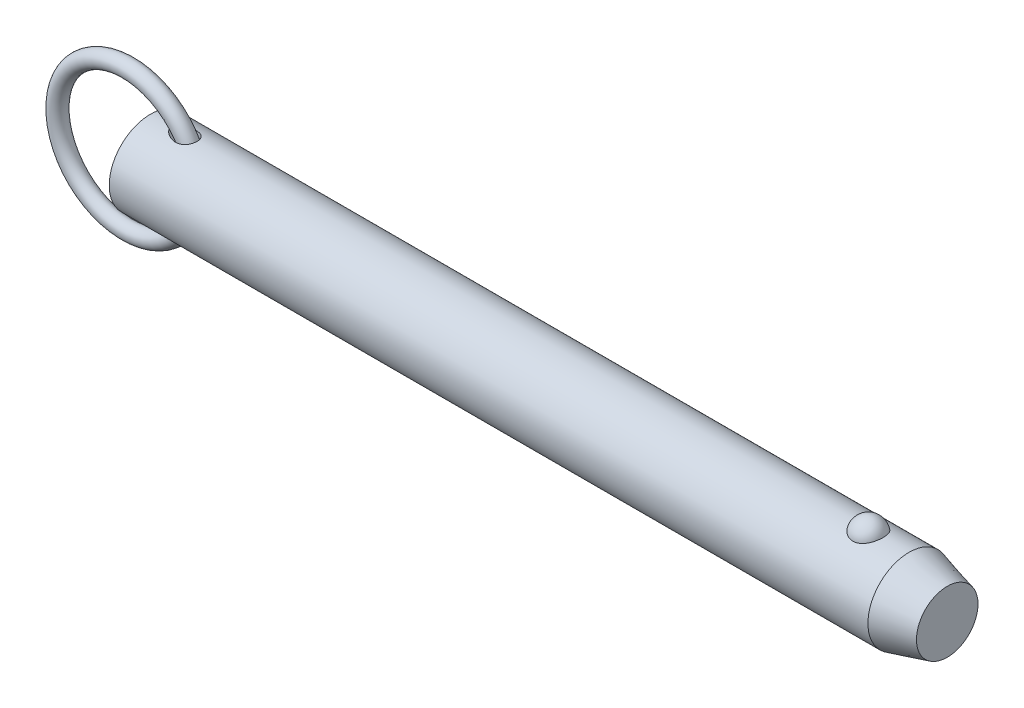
ISO-10303-21;
HEADER;
FILE_DESCRIPTION(('STEP AP214'),'2;1');
FILE_NAME('part.step','',(''),(''),'','','');
FILE_SCHEMA(('AUTOMOTIVE_DESIGN { 1 0 10303 214 1 1 1 1 }'));
ENDSEC;
DATA;
#1=APPLICATION_CONTEXT('core data for automotive mechanical design processes');
#2=APPLICATION_PROTOCOL_DEFINITION('international standard','automotive_design',2000,#1);
#3=PRODUCT_CONTEXT('',#1,'mechanical');
#4=PRODUCT('Part','Part','',(#3));
#5=PRODUCT_RELATED_PRODUCT_CATEGORY('part','',(#4));
#6=PRODUCT_DEFINITION_FORMATION('','',#4);
#7=PRODUCT_DEFINITION_CONTEXT('part definition',#1,'design');
#8=PRODUCT_DEFINITION('design','',#6,#7);
#9=PRODUCT_DEFINITION_SHAPE('','',#8);
#10=(LENGTH_UNIT() NAMED_UNIT(*) SI_UNIT(.MILLI.,.METRE.));
#11=(NAMED_UNIT(*) PLANE_ANGLE_UNIT() SI_UNIT($,.RADIAN.));
#12=(NAMED_UNIT(*) SI_UNIT($,.STERADIAN.) SOLID_ANGLE_UNIT());
#13=UNCERTAINTY_MEASURE_WITH_UNIT(LENGTH_MEASURE(1.E-05),#10,'distance_accuracy_value','');
#14=(GEOMETRIC_REPRESENTATION_CONTEXT(3) GLOBAL_UNCERTAINTY_ASSIGNED_CONTEXT((#13)) GLOBAL_UNIT_ASSIGNED_CONTEXT((#10,
#11,#12)) REPRESENTATION_CONTEXT('',''));
#15=CARTESIAN_POINT('',(0.,0.,0.));
#16=DIRECTION('',(0.,0.,1.));
#17=DIRECTION('',(1.,0.,0.));
#18=AXIS2_PLACEMENT_3D('',#15,#16,#17);
#19=CARTESIAN_POINT('',(-6.08699288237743,0.,0.));
#20=DIRECTION('',(0.,0.,1.));
#21=DIRECTION('',(1.,0.,0.));
#22=AXIS2_PLACEMENT_3D('',#19,#20,#21);
#23=TOROIDAL_SURFACE('',#22,19.05,2.223);
#24=CARTESIAN_POINT('',(15.1860071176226,0.,0.));
#25=VERTEX_POINT('',#24);
#26=VERTEX_LOOP('',#25);
#27=FACE_BOUND('',#26,.T.);
#28=ADVANCED_FACE('P0_F12',(#27),#23,.T.);
#29=CLOSED_SHELL('',(#28));
#30=MANIFOLD_SOLID_BREP('P0_B1',#29);
#31=CARTESIAN_POINT('',(0.,0.,0.));
#32=DIRECTION('',(1.,0.,0.));
#33=DIRECTION('',(0.,0.,-1.));
#34=AXIS2_PLACEMENT_3D('',#31,#32,#33);
#35=CYLINDRICAL_SURFACE('',#34,11.115);
#36=CARTESIAN_POINT('',(6.41405181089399,11.0227946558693,-1.4287136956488));
#37=CARTESIAN_POINT('',(6.49338916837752,11.0115377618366,-1.51556642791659));
#38=CARTESIAN_POINT('',(6.5776546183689,10.9998263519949,-1.59789397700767));
#39=CARTESIAN_POINT('',(6.75386647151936,10.9760304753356,-1.75391400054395));
#40=CARTESIAN_POINT('',(6.84582247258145,10.9639455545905,-1.82759540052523));
#41=CARTESIAN_POINT('',(7.03627827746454,10.9397989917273,-1.96698954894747));
#42=CARTESIAN_POINT('',(7.1348083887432,10.9277377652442,-2.03266078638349));
#43=CARTESIAN_POINT('',(7.33681032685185,10.9041015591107,-2.1558582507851));
#44=CARTESIAN_POINT('',(7.44028007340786,10.8925263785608,-2.21338786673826));
#45=CARTESIAN_POINT('',(7.64386117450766,10.8710104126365,-2.31666528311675));
#46=CARTESIAN_POINT('',(7.74368989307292,10.8610119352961,-2.36295942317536));
#47=CARTESIAN_POINT('',(7.94637195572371,10.8420168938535,-2.44863486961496));
#48=CARTESIAN_POINT('',(8.0492261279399,10.8330206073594,-2.48801426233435));
#49=CARTESIAN_POINT('',(8.3611557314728,10.807980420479,-2.59542730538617));
#50=CARTESIAN_POINT('',(8.57411849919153,10.7938278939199,-2.65299817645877));
#51=CARTESIAN_POINT('',(9.00825016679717,10.7725818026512,-2.73800108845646));
#52=CARTESIAN_POINT('',(9.22947335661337,10.7655491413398,-2.76517330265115));
#53=CARTESIAN_POINT('',(9.6736814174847,10.7605872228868,-2.78445308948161));
#54=CARTESIAN_POINT('',(9.89666486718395,10.7626512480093,-2.77658653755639));
#55=CARTESIAN_POINT('',(10.2950172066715,10.7754452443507,-2.72644436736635));
#56=CARTESIAN_POINT('',(10.4712789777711,10.7844280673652,-2.69109376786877));
#57=CARTESIAN_POINT('',(10.7292776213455,10.8024982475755,-2.61722365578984));
#58=CARTESIAN_POINT('',(10.8142337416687,10.8092901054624,-2.58911576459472));
#59=CARTESIAN_POINT('',(10.9813218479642,10.8242580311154,-2.52581287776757));
#60=CARTESIAN_POINT('',(11.0634550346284,10.8324335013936,-2.49062094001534));
#61=CARTESIAN_POINT('',(11.2247418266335,10.8500287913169,-2.41281958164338));
#62=CARTESIAN_POINT('',(11.3038694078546,10.8594572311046,-2.37015806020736));
#63=CARTESIAN_POINT('',(11.4576781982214,10.8792243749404,-2.27770403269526));
#64=CARTESIAN_POINT('',(11.5323615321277,10.8895626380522,-2.22791497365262));
#65=CARTESIAN_POINT('',(11.6765388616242,10.9108113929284,-2.12140590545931));
#66=CARTESIAN_POINT('',(11.7460329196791,10.9217218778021,-2.06468597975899));
#67=CARTESIAN_POINT('',(11.8790597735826,10.9437207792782,-1.94471764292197));
#68=CARTESIAN_POINT('',(11.9425932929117,10.9548091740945,-1.88147002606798));
#69=CARTESIAN_POINT('',(12.109388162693,10.9851999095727,-1.69784918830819));
#70=CARTESIAN_POINT('',(12.205655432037,11.0042655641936,-1.57093023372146));
#71=CARTESIAN_POINT('',(12.374151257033,11.0393391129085,-1.3017676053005));
#72=CARTESIAN_POINT('',(12.4463875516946,11.0553479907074,-1.15952888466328));
#73=CARTESIAN_POINT('',(12.5615818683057,11.0816338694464,-0.871972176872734));
#74=CARTESIAN_POINT('',(12.6058896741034,11.0921698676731,-0.727217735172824));
#75=CARTESIAN_POINT('',(12.6699315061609,11.1075802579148,-0.432089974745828));
#76=CARTESIAN_POINT('',(12.6896681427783,11.1124552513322,-0.281717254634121));
#77=CARTESIAN_POINT('',(12.704022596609,11.1159901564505,0.0188164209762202));
#78=CARTESIAN_POINT('',(12.6988836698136,11.1147102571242,0.168965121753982));
#79=CARTESIAN_POINT('',(12.6641681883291,11.1062126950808,0.466238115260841));
#80=CARTESIAN_POINT('',(12.6345920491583,11.0989951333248,0.61336245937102));
#81=CARTESIAN_POINT('',(12.5517453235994,11.0794095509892,0.900330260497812));
#82=CARTESIAN_POINT('',(12.4984878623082,11.0670443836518,1.0401777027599));
#83=CARTESIAN_POINT('',(12.3696588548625,11.0385082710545,1.308745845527));
#84=CARTESIAN_POINT('',(12.2940887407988,11.0223375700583,1.43746725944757));
#85=CARTESIAN_POINT('',(12.122380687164,10.987872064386,1.68079704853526));
#86=CARTESIAN_POINT('',(12.0261637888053,10.969569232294,1.79534850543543));
#87=CARTESIAN_POINT('',(11.8161707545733,10.932836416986,2.00695695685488));
#88=CARTESIAN_POINT('',(11.7023941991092,10.9144064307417,2.10401353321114));
#89=CARTESIAN_POINT('',(11.4575656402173,10.8788057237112,2.28105326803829));
#90=CARTESIAN_POINT('',(11.3261451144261,10.8616794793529,2.36053412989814));
#91=CARTESIAN_POINT('',(11.0523589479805,10.8308019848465,2.49839044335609));
#92=CARTESIAN_POINT('',(10.9099908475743,10.8170514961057,2.55676113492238));
#93=CARTESIAN_POINT('',(10.6060622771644,10.7929728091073,2.65666105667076));
#94=CARTESIAN_POINT('',(10.4438877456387,10.7830209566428,2.69640163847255));
#95=CARTESIAN_POINT('',(10.1154037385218,10.7687230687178,2.75293129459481));
#96=CARTESIAN_POINT('',(9.94909141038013,10.7643810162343,2.76970406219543));
#97=CARTESIAN_POINT('',(9.54387061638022,10.7604809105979,2.7848723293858));
#98=CARTESIAN_POINT('',(9.30446860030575,10.7637793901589,2.77227753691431));
#99=CARTESIAN_POINT('',(8.94961255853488,10.7757341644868,2.72524141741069));
#100=CARTESIAN_POINT('',(8.83186896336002,10.7808994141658,2.70482239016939));
#101=CARTESIAN_POINT('',(8.59835142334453,10.7932548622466,2.65509992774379));
#102=CARTESIAN_POINT('',(8.48257728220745,10.8004448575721,2.62579738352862));
#103=CARTESIAN_POINT('',(8.25208469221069,10.8166382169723,2.55827624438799));
#104=CARTESIAN_POINT('',(8.1374021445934,10.8256649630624,2.51994155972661));
#105=CARTESIAN_POINT('',(7.91132058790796,10.8451170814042,2.43486475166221));
#106=CARTESIAN_POINT('',(7.79992154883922,10.8555424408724,2.38812270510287));
#107=CARTESIAN_POINT('',(7.58115677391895,10.8774251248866,2.28638483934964));
#108=CARTESIAN_POINT('',(7.47378802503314,10.8888816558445,2.23139534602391));
#109=CARTESIAN_POINT('',(7.26385624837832,10.9124540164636,2.11310265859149));
#110=CARTESIAN_POINT('',(7.16129168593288,10.9245696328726,2.04980214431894));
#111=CARTESIAN_POINT('',(6.91882218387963,10.9543689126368,1.88540538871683));
#112=CARTESIAN_POINT('',(6.78193778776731,10.9721958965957,1.77979827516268));
#113=CARTESIAN_POINT('',(6.52472441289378,11.0070222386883,1.54989693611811));
#114=CARTESIAN_POINT('',(6.40436902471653,11.0240228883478,1.42563320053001));
#115=CARTESIAN_POINT('',(6.21838804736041,11.0509658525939,1.19529359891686));
#116=CARTESIAN_POINT('',(6.14691885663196,11.0615430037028,1.09404520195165));
#117=CARTESIAN_POINT('',(6.0204349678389,11.0805004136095,0.881508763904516));
#118=CARTESIAN_POINT('',(5.96539400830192,11.0888841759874,0.770237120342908));
#119=CARTESIAN_POINT('',(5.88475453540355,11.1012553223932,0.560577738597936));
#120=CARTESIAN_POINT('',(5.85559643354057,11.1057686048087,0.463603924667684));
#121=CARTESIAN_POINT('',(5.81381299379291,11.1122523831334,0.266083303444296));
#122=CARTESIAN_POINT('',(5.80117118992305,11.1142254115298,0.165540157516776));
#123=CARTESIAN_POINT('',(5.79363815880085,11.1153999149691,-0.0364747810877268));
#124=CARTESIAN_POINT('',(5.79878799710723,11.1145949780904,-0.137948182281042));
#125=CARTESIAN_POINT('',(5.82639592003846,11.1102987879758,-0.338493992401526));
#126=CARTESIAN_POINT('',(5.8488723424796,11.1068046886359,-0.437563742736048));
#127=CARTESIAN_POINT('',(5.91510741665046,11.0965857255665,-0.649968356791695));
#128=CARTESIAN_POINT('',(5.96220905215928,11.0893566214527,-0.7622229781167));
#129=CARTESIAN_POINT('',(6.0737844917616,11.072471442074,-0.977396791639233));
#130=CARTESIAN_POINT('',(6.13826787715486,11.0628140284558,-1.08031079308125));
#131=CARTESIAN_POINT('',(6.24101077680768,11.0477136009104,-1.2219580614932));
#132=CARTESIAN_POINT('',(6.27403486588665,11.042895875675,-1.26469183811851));
#133=CARTESIAN_POINT('',(6.34238022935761,11.0330152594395,-1.34817011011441));
#134=CARTESIAN_POINT('',(6.37769867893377,11.0279526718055,-1.38891694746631));
#135=CARTESIAN_POINT('',(6.41405181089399,11.0227946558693,-1.4287136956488));
#136=B_SPLINE_CURVE_WITH_KNOTS('',3,(#36,#37,#38,#39,#40,#41,#42,#43,#44,#45,#46,#47,#48,#49,
#50,#51,#52,#53,#54,#55,#56,#57,#58,#59,#60,#61,#62,#63,#64,#65,#66,#67,#68,#69,#70,#71,#72,#73,
#74,#75,#76,#77,#78,#79,#80,#81,#82,#83,#84,#85,#86,#87,#88,#89,#90,#91,#92,#93,#94,#95,#96,#97,
#98,#99,#100,#101,#102,#103,#104,#105,#106,#107,#108,#109,#110,#111,#112,#113,#114,#115,#116,
#117,#118,#119,#120,#121,#122,#123,#124,#125,#126,#127,#128,#129,#130,#131,#132,#133,#134,#135),
.UNSPECIFIED.,.T.,.F.,(4,2,2,2,2,2,2,2,2,2,2,2,2,2,2,2,2,2,2,2,2,2,2,2,2,2,2,2,2,2,2,2,2,2,2,2,
2,2,2,2,2,2,2,2,2,2,2,2,2,4),(0.,0.354433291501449,0.709315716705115,1.0659654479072,
1.42246628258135,1.75367157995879,2.08496839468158,2.74582009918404,3.41227815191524,
4.07824412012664,4.61583787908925,4.88478112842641,5.1536085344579,5.42439170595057,
5.69504436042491,5.96569375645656,6.23631025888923,6.71490729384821,7.19335005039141,
7.64641437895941,8.09943057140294,8.54802575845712,8.99661331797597,9.44495256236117,
9.89326303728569,10.3433195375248,10.7933867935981,11.2550086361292,11.7167345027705,
12.2165866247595,12.7167934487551,13.4318876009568,13.7904664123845,14.1490092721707,
14.5124394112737,14.8758662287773,15.239015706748,15.6020483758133,16.1219860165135,
16.6410830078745,17.0130520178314,17.3844231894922,17.6872330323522,17.9897407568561,
18.2929471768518,18.5964749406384,18.9603532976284,19.3244326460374,19.4870338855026,
19.649438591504),.UNSPECIFIED.);
#137=CARTESIAN_POINT('',(6.41405181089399,11.0227946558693,-1.4287136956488));
#138=VERTEX_POINT('',#137);
#139=EDGE_CURVE('P1_E40',#138,#138,#136,.T.);
#140=ORIENTED_EDGE('',*,*,#139,.T.);
#141=EDGE_LOOP('',(#140));
#142=FACE_BOUND('',#141,.T.);
#143=CARTESIAN_POINT('',(205.529563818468,0.,0.));
#144=DIRECTION('',(1.,0.,0.));
#145=DIRECTION('',(0.,0.,-1.));
#146=AXIS2_PLACEMENT_3D('',#143,#144,#145);
#147=CIRCLE('',#146,11.115);
#148=CARTESIAN_POINT('',(205.529563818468,0.,-11.115));
#149=VERTEX_POINT('',#148);
#150=EDGE_CURVE('P1_E25',#149,#149,#147,.T.);
#151=ORIENTED_EDGE('',*,*,#150,.F.);
#152=EDGE_LOOP('',(#151));
#153=FACE_BOUND('',#152,.T.);
#154=CARTESIAN_POINT('',(0.,0.,0.));
#155=DIRECTION('',(1.,0.,0.));
#156=DIRECTION('',(0.,0.,-1.));
#157=AXIS2_PLACEMENT_3D('',#154,#155,#156);
#158=CIRCLE('',#157,11.115);
#159=CARTESIAN_POINT('',(0.,0.,-11.115));
#160=VERTEX_POINT('',#159);
#161=EDGE_CURVE('P1_E9',#160,#160,#158,.T.);
#162=ORIENTED_EDGE('',*,*,#161,.T.);
#163=EDGE_LOOP('',(#162));
#164=FACE_BOUND('',#163,.T.);
#165=CARTESIAN_POINT('',(194.531068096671,10.3028087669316,4.17077409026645));
#166=CARTESIAN_POINT('',(194.314775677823,10.3028003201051,4.17078240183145));
#167=CARTESIAN_POINT('',(194.098548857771,10.3098895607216,4.15340593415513));
#168=CARTESIAN_POINT('',(193.672540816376,10.3373834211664,4.08449540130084));
#169=CARTESIAN_POINT('',(193.462757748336,10.3577841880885,4.03297121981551));
#170=CARTESIAN_POINT('',(193.055782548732,10.4095237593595,3.89746513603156));
#171=CARTESIAN_POINT('',(192.858572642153,10.4408466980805,3.81353029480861));
#172=CARTESIAN_POINT('',(192.481338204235,10.5110236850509,3.61560339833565));
#173=CARTESIAN_POINT('',(192.301317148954,10.5498792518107,3.50160528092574));
#174=CARTESIAN_POINT('',(191.957684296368,10.6322884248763,3.24292464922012));
#175=CARTESIAN_POINT('',(191.794686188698,10.6759443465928,3.09746040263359));
#176=CARTESIAN_POINT('',(191.494591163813,10.7625291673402,2.78171925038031));
#177=CARTESIAN_POINT('',(191.357499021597,10.8054579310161,2.61143778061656));
#178=CARTESIAN_POINT('',(191.106408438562,10.8881935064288,2.24226695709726));
#179=CARTESIAN_POINT('',(190.993710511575,10.9277761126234,2.04244123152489));
#180=CARTESIAN_POINT('',(190.801777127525,10.997484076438,1.62578254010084));
#181=CARTESIAN_POINT('',(190.722544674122,11.0276085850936,1.40894804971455));
#182=CARTESIAN_POINT('',(190.598303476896,11.0756732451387,0.961250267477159));
#183=CARTESIAN_POINT('',(190.553760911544,11.0934470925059,0.73023943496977));
#184=CARTESIAN_POINT('',(190.501569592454,11.1143331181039,0.26343964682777));
#185=CARTESIAN_POINT('',(190.493920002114,11.1174456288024,0.0276507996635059));
#186=CARTESIAN_POINT('',(190.51561056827,11.1087161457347,-0.440729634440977));
#187=CARTESIAN_POINT('',(190.544762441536,11.0969502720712,-0.673331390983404));
#188=CARTESIAN_POINT('',(190.639143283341,11.0597872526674,-1.12996621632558));
#189=CARTESIAN_POINT('',(190.704372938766,11.0343898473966,-1.35399912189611));
#190=CARTESIAN_POINT('',(190.86969844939,10.972515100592,-1.78750286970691));
#191=CARTESIAN_POINT('',(190.96983863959,10.9360236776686,-1.99695478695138));
#192=CARTESIAN_POINT('',(191.202940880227,10.8557595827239,-2.39520667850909));
#193=CARTESIAN_POINT('',(191.335905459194,10.8119863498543,-2.58400506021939));
#194=CARTESIAN_POINT('',(191.632407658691,10.7216733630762,-2.93635726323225));
#195=CARTESIAN_POINT('',(191.796056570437,10.675123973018,-3.09981510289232));
#196=CARTESIAN_POINT('',(192.149860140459,10.5846571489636,-3.39592247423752));
#197=CARTESIAN_POINT('',(192.340012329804,10.5407394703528,-3.52857487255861));
#198=CARTESIAN_POINT('',(192.73750141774,10.4616690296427,-3.75646057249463));
#199=CARTESIAN_POINT('',(192.94436705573,10.4263443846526,-3.85245432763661));
#200=CARTESIAN_POINT('',(193.37295417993,10.3675574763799,-4.00798747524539));
#201=CARTESIAN_POINT('',(193.594670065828,10.3440907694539,-4.0675405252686));
#202=CARTESIAN_POINT('',(194.034669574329,10.3128282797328,-4.14614314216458));
#203=CARTESIAN_POINT('',(194.252565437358,10.3043040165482,-4.1670783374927));
#204=CARTESIAN_POINT('',(194.68894951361,10.3016771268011,-4.17357158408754));
#205=CARTESIAN_POINT('',(194.907437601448,10.3075716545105,-4.15913661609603));
#206=CARTESIAN_POINT('',(195.331744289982,10.3326686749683,-4.09636961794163));
#207=CARTESIAN_POINT('',(195.537745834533,10.3514555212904,-4.04909574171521));
#208=CARTESIAN_POINT('',(195.938576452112,10.399818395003,-3.92320197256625));
#209=CARTESIAN_POINT('',(196.1334046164,10.4293952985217,-3.84457953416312));
#210=CARTESIAN_POINT('',(196.511191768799,10.4969600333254,-3.65612410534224));
#211=CARTESIAN_POINT('',(196.693797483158,10.5351178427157,-3.54564545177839));
#212=CARTESIAN_POINT('',(197.038204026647,10.6154999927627,-3.29718036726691));
#213=CARTESIAN_POINT('',(197.200000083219,10.657725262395,-3.15918764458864));
#214=CARTESIAN_POINT('',(197.506959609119,10.744212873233,-2.85163580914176));
#215=CARTESIAN_POINT('',(197.650891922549,10.7884718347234,-2.68084605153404));
#216=CARTESIAN_POINT('',(197.909237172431,10.872374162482,-2.31721864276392));
#217=CARTESIAN_POINT('',(198.023644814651,10.9120167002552,-2.12437704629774));
#218=CARTESIAN_POINT('',(198.223873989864,10.9838919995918,-1.71516999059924));
#219=CARTESIAN_POINT('',(198.30866178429,11.0158465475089,-1.49824866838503));
#220=CARTESIAN_POINT('',(198.44268382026,11.0673523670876,-1.05228572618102));
#221=CARTESIAN_POINT('',(198.491917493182,11.086903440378,-0.823243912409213));
#222=CARTESIAN_POINT('',(198.553891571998,11.1116323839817,-0.359087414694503));
#223=CARTESIAN_POINT('',(198.566566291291,11.1167843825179,-0.123962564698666));
#224=CARTESIAN_POINT('',(198.554973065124,11.1121144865,0.345220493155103));
#225=CARTESIAN_POINT('',(198.530705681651,11.1022928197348,0.579278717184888));
#226=CARTESIAN_POINT('',(198.445907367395,11.0687504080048,1.03866534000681));
#227=CARTESIAN_POINT('',(198.385529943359,11.0450885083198,1.26402641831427));
#228=CARTESIAN_POINT('',(198.229853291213,10.9863185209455,1.70076772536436));
#229=CARTESIAN_POINT('',(198.134551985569,10.9512097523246,1.91214712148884));
#230=CARTESIAN_POINT('',(197.910397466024,10.8729733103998,2.316083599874));
#231=CARTESIAN_POINT('',(197.781380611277,10.8298068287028,2.50854240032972));
#232=CARTESIAN_POINT('',(197.492732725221,10.7401896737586,2.86808766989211));
#233=CARTESIAN_POINT('',(197.333102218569,10.6937390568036,3.03517457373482));
#234=CARTESIAN_POINT('',(196.987534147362,10.6029321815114,3.33857581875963));
#235=CARTESIAN_POINT('',(196.801708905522,10.5585680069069,3.47501541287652));
#236=CARTESIAN_POINT('',(196.407875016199,10.4769321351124,3.71390897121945));
#237=CARTESIAN_POINT('',(196.199863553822,10.439661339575,3.81635861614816));
#238=CARTESIAN_POINT('',(195.754066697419,10.3749407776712,3.98910631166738));
#239=CARTESIAN_POINT('',(195.515234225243,10.3482457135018,4.05700929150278));
#240=CARTESIAN_POINT('',(195.027925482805,10.312188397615,4.14782844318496));
#241=CARTESIAN_POINT('',(194.779453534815,10.3028184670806,4.17076454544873));
#242=CARTESIAN_POINT('',(194.531068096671,10.3028087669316,4.17077409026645));
#243=B_SPLINE_CURVE_WITH_KNOTS('',3,(#165,#166,#167,#168,#169,#170,#171,#172,#173,#174,#175,
#176,#177,#178,#179,#180,#181,#182,#183,#184,#185,#186,#187,#188,#189,#190,#191,#192,#193,#194,
#195,#196,#197,#198,#199,#200,#201,#202,#203,#204,#205,#206,#207,#208,#209,#210,#211,#212,#213,
#214,#215,#216,#217,#218,#219,#220,#221,#222,#223,#224,#225,#226,#227,#228,#229,#230,#231,#232,
#233,#234,#235,#236,#237,#238,#239,#240,#241,#242),.UNSPECIFIED.,.T.,.F.,(4,2,2,2,2,2,2,2,2,2,2,
2,2,2,2,2,2,2,2,2,2,2,2,2,2,2,2,2,2,2,2,2,2,2,2,2,2,2,4),(0.,0.647966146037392,1.29574482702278,
1.94258643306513,2.58955857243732,3.25496465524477,3.92049326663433,4.61566368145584,
5.31089647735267,6.01531821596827,6.71972398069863,7.42054043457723,8.12137023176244,
8.8230933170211,9.52487047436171,10.2292439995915,10.9335519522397,11.6223330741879,
12.3108558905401,12.9647664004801,13.6185478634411,14.252184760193,14.8858731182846,
15.5334360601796,16.1811472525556,16.8611459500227,17.5412664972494,18.2431855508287,
18.9451158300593,19.6483065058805,20.3514864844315,21.0516982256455,21.7519516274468,
22.4556690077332,23.1593743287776,23.8601491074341,24.5610129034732,25.3054529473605,
26.049562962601),.UNSPECIFIED.);
#244=CARTESIAN_POINT('',(194.531068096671,10.3028087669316,4.17077409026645));
#245=VERTEX_POINT('',#244);
#246=EDGE_CURVE('P1_E34',#245,#245,#243,.T.);
#247=ORIENTED_EDGE('',*,*,#246,.T.);
#248=EDGE_LOOP('',(#247));
#249=FACE_BOUND('',#248,.T.);
#250=CARTESIAN_POINT('',(6.41405181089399,-11.0227946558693,-1.4287136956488));
#251=CARTESIAN_POINT('',(6.3312406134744,-11.0345445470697,-1.33806125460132));
#252=CARTESIAN_POINT('',(6.25372866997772,-11.0458090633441,-1.24240732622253));
#253=CARTESIAN_POINT('',(6.11277905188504,-11.0666115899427,-1.04095704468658));
#254=CARTESIAN_POINT('',(6.04933920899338,-11.0761498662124,-0.935162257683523));
#255=CARTESIAN_POINT('',(5.94029181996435,-11.0927063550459,-0.712476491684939));
#256=CARTESIAN_POINT('',(5.89492964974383,-11.0996897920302,-0.595457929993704));
#257=CARTESIAN_POINT('',(5.84498161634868,-11.1074141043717,-0.414997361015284));
#258=CARTESIAN_POINT('',(5.83135004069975,-11.1095300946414,-0.354047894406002));
#259=CARTESIAN_POINT('',(5.81051649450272,-11.1127688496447,-0.231041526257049));
#260=CARTESIAN_POINT('',(5.80331311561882,-11.1138918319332,-0.1689848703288));
#261=CARTESIAN_POINT('',(5.7929652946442,-11.1155042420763,-0.000484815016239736));
#262=CARTESIAN_POINT('',(5.79625267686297,-11.1149904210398,0.106437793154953));
#263=CARTESIAN_POINT('',(5.82213676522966,-11.1109609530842,0.317809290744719));
#264=CARTESIAN_POINT('',(5.84474662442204,-11.1074432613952,0.422256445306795));
#265=CARTESIAN_POINT('',(5.911131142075,-11.097197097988,0.63936180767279));
#266=CARTESIAN_POINT('',(5.95733120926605,-11.090102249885,0.751250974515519));
#267=CARTESIAN_POINT('',(6.06709542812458,-11.0734770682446,0.965912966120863));
#268=CARTESIAN_POINT('',(6.13068735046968,-11.06394284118,1.06867085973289));
#269=CARTESIAN_POINT('',(6.30294237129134,-11.0385920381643,1.30890635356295));
#270=CARTESIAN_POINT('',(6.41896200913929,-11.0218881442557,1.44097376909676));
#271=CARTESIAN_POINT('',(6.66989654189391,-10.9871512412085,1.68553954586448));
#272=CARTESIAN_POINT('',(6.80485520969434,-10.9691152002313,1.79799117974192));
#273=CARTESIAN_POINT('',(7.04881236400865,-10.9382283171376,1.97587596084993));
#274=CARTESIAN_POINT('',(7.15465712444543,-10.9253240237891,2.04570822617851));
#275=CARTESIAN_POINT('',(7.37202504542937,-10.9000987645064,2.17611840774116));
#276=CARTESIAN_POINT('',(7.48355057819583,-10.8877780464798,2.23669241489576));
#277=CARTESIAN_POINT('',(7.71132418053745,-10.8641580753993,2.34873831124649));
#278=CARTESIAN_POINT('',(7.82757727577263,-10.8528599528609,2.40020018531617));
#279=CARTESIAN_POINT('',(8.06386825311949,-10.8317234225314,2.49385169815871));
#280=CARTESIAN_POINT('',(8.18390558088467,-10.8218848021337,2.53604268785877));
#281=CARTESIAN_POINT('',(8.42918336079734,-10.8039208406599,2.61152283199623));
#282=CARTESIAN_POINT('',(8.55447802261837,-10.7958283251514,2.64464414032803));
#283=CARTESIAN_POINT('',(8.8075212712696,-10.781995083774,2.70048793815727));
#284=CARTESIAN_POINT('',(8.93527019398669,-10.7762546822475,2.72320899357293));
#285=CARTESIAN_POINT('',(9.19210176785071,-10.7675291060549,2.75750994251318));
#286=CARTESIAN_POINT('',(9.32118105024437,-10.7645381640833,2.76911315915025));
#287=CARTESIAN_POINT('',(9.57984338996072,-10.761622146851,2.78042035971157));
#288=CARTESIAN_POINT('',(9.70942621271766,-10.7616957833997,2.78012934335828));
#289=CARTESIAN_POINT('',(10.0243125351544,-10.7659059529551,2.76381534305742));
#290=CARTESIAN_POINT('',(10.209307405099,-10.7717977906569,2.74099674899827));
#291=CARTESIAN_POINT('',(10.5731188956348,-10.7905408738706,2.66626238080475));
#292=CARTESIAN_POINT('',(10.7519389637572,-10.8033881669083,2.61436313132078));
#293=CARTESIAN_POINT('',(11.0114289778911,-10.8271584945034,2.51336808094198));
#294=CARTESIAN_POINT('',(11.096831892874,-10.835881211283,2.47562331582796));
#295=CARTESIAN_POINT('',(11.2636000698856,-10.8545688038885,2.39236170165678));
#296=CARTESIAN_POINT('',(11.3449673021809,-10.8645330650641,2.3468486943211));
#297=CARTESIAN_POINT('',(11.5027832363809,-10.8853818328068,2.24815967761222));
#298=CARTESIAN_POINT('',(11.5792327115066,-10.8962661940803,2.19498487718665));
#299=CARTESIAN_POINT('',(11.7263315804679,-10.9185541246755,2.08128855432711));
#300=CARTESIAN_POINT('',(11.7969818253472,-10.9299576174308,2.02076811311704));
#301=CARTESIAN_POINT('',(11.9817953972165,-10.9613645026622,1.84513663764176));
#302=CARTESIAN_POINT('',(12.0893012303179,-10.9814643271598,1.72286660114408));
#303=CARTESIAN_POINT('',(12.2803576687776,-11.0193991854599,1.46066991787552));
#304=CARTESIAN_POINT('',(12.3639173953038,-11.0372350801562,1.3207500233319));
#305=CARTESIAN_POINT('',(12.4996220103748,-11.0672969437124,1.03778067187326));
#306=CARTESIAN_POINT('',(12.5535315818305,-11.0798242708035,0.895607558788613));
#307=CARTESIAN_POINT('',(12.636874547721,-11.0995427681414,0.603918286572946));
#308=CARTESIAN_POINT('',(12.6663115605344,-11.1067347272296,0.454403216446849));
#309=CARTESIAN_POINT('',(12.6997387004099,-11.1149224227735,0.154577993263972));
#310=CARTESIAN_POINT('',(12.7040886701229,-11.1160057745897,0.00431019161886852));
#311=CARTESIAN_POINT('',(12.6882048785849,-11.1120956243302,-0.294841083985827));
#312=CARTESIAN_POINT('',(12.6679715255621,-11.1071022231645,-0.443724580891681));
#313=CARTESIAN_POINT('',(12.6034470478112,-11.0915888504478,-0.735688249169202));
#314=CARTESIAN_POINT('',(12.5591858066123,-11.0810757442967,-0.878775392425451));
#315=CARTESIAN_POINT('',(12.4477416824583,-11.0556687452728,-1.15529525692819));
#316=CARTESIAN_POINT('',(12.3805601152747,-11.0407751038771,-1.2887285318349));
#317=CARTESIAN_POINT('',(12.2248919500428,-11.0081839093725,-1.54257976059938));
#318=CARTESIAN_POINT('',(12.1363549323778,-10.9904797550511,-1.66296592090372));
#319=CARTESIAN_POINT('',(11.9406137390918,-10.9541951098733,-1.88726577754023));
#320=CARTESIAN_POINT('',(11.833409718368,-10.9356146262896,-1.99117961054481));
#321=CARTESIAN_POINT('',(11.601318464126,-10.8991360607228,-2.18213646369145));
#322=CARTESIAN_POINT('',(11.4761325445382,-10.8812577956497,-2.26881927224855));
#323=CARTESIAN_POINT('',(11.2134852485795,-10.8482871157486,-2.42157282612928));
#324=CARTESIAN_POINT('',(11.0760218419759,-10.8331951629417,-2.48764015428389));
#325=CARTESIAN_POINT('',(10.7828968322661,-10.8061050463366,-2.60290068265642));
#326=CARTESIAN_POINT('',(10.6266338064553,-10.7943907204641,-2.65062248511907));
#327=CARTESIAN_POINT('',(10.3086617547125,-10.7762429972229,-2.72345054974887));
#328=CARTESIAN_POINT('',(10.146948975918,-10.7698133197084,-2.74854088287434));
#329=CARTESIAN_POINT('',(9.75541304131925,-10.7608036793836,-2.78368719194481));
#330=CARTESIAN_POINT('',(9.52459435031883,-10.7608467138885,-2.78350276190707));
#331=CARTESIAN_POINT('',(9.0660496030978,-10.7702674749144,-2.74677945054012));
#332=CARTESIAN_POINT('',(8.83832966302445,-10.7796615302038,-2.71017697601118));
#333=CARTESIAN_POINT('',(8.38783466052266,-10.8058248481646,-2.60392490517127));
#334=CARTESIAN_POINT('',(8.16517101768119,-10.8226939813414,-2.53382676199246));
#335=CARTESIAN_POINT('',(7.84087311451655,-10.8516548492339,-2.40555545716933));
#336=CARTESIAN_POINT('',(7.73435551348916,-10.8619221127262,-2.35892455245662));
#337=CARTESIAN_POINT('',(7.52510420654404,-10.883357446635,-2.25797017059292));
#338=CARTESIAN_POINT('',(7.42236986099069,-10.8945253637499,-2.20364800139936));
#339=CARTESIAN_POINT('',(7.23808758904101,-10.915528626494,-2.09688018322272));
#340=CARTESIAN_POINT('',(7.15584631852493,-10.9252787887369,-2.04561072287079));
#341=CARTESIAN_POINT('',(6.99510576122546,-10.944960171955,-1.93754729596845));
#342=CARTESIAN_POINT('',(6.91660574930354,-10.9548913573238,-1.88075440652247));
#343=CARTESIAN_POINT('',(6.76418133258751,-10.974690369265,-1.7615450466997));
#344=CARTESIAN_POINT('',(6.69024940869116,-10.984558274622,-1.69913825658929));
#345=CARTESIAN_POINT('',(6.54780119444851,-11.0039826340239,-1.56842485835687));
#346=CARTESIAN_POINT('',(6.47928247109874,-11.0135392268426,-1.50012092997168));
#347=CARTESIAN_POINT('',(6.41405181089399,-11.0227946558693,-1.4287136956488));
#348=B_SPLINE_CURVE_WITH_KNOTS('',3,(#250,#251,#252,#253,#254,#255,#256,#257,#258,#259,#260,
#261,#262,#263,#264,#265,#266,#267,#268,#269,#270,#271,#272,#273,#274,#275,#276,#277,#278,#279,
#280,#281,#282,#283,#284,#285,#286,#287,#288,#289,#290,#291,#292,#293,#294,#295,#296,#297,#298,
#299,#300,#301,#302,#303,#304,#305,#306,#307,#308,#309,#310,#311,#312,#313,#314,#315,#316,#317,
#318,#319,#320,#321,#322,#323,#324,#325,#326,#327,#328,#329,#330,#331,#332,#333,#334,#335,#336,
#337,#338,#339,#340,#341,#342,#343,#344,#345,#346,#347),.UNSPECIFIED.,.T.,.F.,(4,2,2,2,2,2,2,2,
2,2,2,2,2,2,2,2,2,2,2,2,2,2,2,2,2,2,2,2,2,2,2,2,2,2,2,2,2,2,2,2,2,2,2,2,2,2,2,2,4),(0.,
0.36983565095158,0.739614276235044,1.1142538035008,1.30141910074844,1.48854338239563,
1.8074587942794,2.12659146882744,2.4883888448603,2.85076733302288,3.3776216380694,
3.90571433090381,4.287639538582,4.66972556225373,5.05222896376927,5.43467659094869,
5.82378546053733,6.21294796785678,6.6012922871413,6.98947336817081,7.54669558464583,
8.10360148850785,8.38458539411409,8.66543074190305,8.94623182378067,9.22699162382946,
9.7162888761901,10.2053995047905,10.6608871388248,11.1163074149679,11.5651786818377,
12.0140424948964,12.4623493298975,12.9106304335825,13.3599804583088,13.8093267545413,
14.2672570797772,14.7252632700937,15.214740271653,15.7045615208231,16.3932594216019,
17.083162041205,17.7825738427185,18.1325177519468,18.4824022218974,18.7744056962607,
19.0663523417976,19.3578048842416,19.6491256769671),.UNSPECIFIED.);
#349=CARTESIAN_POINT('',(6.41405181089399,-11.0227946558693,-1.4287136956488));
#350=VERTEX_POINT('',#349);
#351=EDGE_CURVE('P1_E17',#350,#350,#348,.T.);
#352=ORIENTED_EDGE('',*,*,#351,.T.);
#353=EDGE_LOOP('',(#352));
#354=FACE_BOUND('',#353,.T.);
#355=ADVANCED_FACE('P1_F13',(#142,#153,#164,#249,#354),#35,.T.);
#356=CARTESIAN_POINT('',(0.,0.,0.));
#357=DIRECTION('',(-1.,0.,0.));
#358=DIRECTION('',(0.,0.,1.));
#359=AXIS2_PLACEMENT_3D('',#356,#357,#358);
#360=PLANE('',#359);
#361=ORIENTED_EDGE('',*,*,#161,.F.);
#362=EDGE_LOOP('',(#361));
#363=FACE_BOUND('',#362,.T.);
#364=ADVANCED_FACE('P1_F15',(#363),#360,.T.);
#365=CARTESIAN_POINT('',(215.9,0.,0.));
#366=DIRECTION('',(-1.,0.,0.));
#367=DIRECTION('',(0.,0.,1.));
#368=AXIS2_PLACEMENT_3D('',#365,#366,#367);
#369=CONICAL_SURFACE('',#368,8.33625000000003,0.26179938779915);
#370=ORIENTED_EDGE('',*,*,#150,.T.);
#371=EDGE_LOOP('',(#370));
#372=FACE_BOUND('',#371,.T.);
#373=CARTESIAN_POINT('',(215.9,0.,0.));
#374=DIRECTION('',(1.,0.,0.));
#375=DIRECTION('',(0.,0.,-1.));
#376=AXIS2_PLACEMENT_3D('',#373,#374,#375);
#377=CIRCLE('',#376,8.33625000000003);
#378=CARTESIAN_POINT('',(215.9,0.,-8.33625000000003));
#379=VERTEX_POINT('',#378);
#380=EDGE_CURVE('P1_E30',#379,#379,#377,.T.);
#381=ORIENTED_EDGE('',*,*,#380,.F.);
#382=EDGE_LOOP('',(#381));
#383=FACE_BOUND('',#382,.T.);
#384=ADVANCED_FACE('P1_F55',(#372,#383),#369,.T.);
#385=CARTESIAN_POINT('',(215.9,8.33625000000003,0.));
#386=DIRECTION('',(1.,0.,0.));
#387=DIRECTION('',(0.,0.,-1.));
#388=AXIS2_PLACEMENT_3D('',#385,#386,#387);
#389=PLANE('',#388);
#390=ORIENTED_EDGE('',*,*,#380,.T.);
#391=EDGE_LOOP('',(#390));
#392=FACE_BOUND('',#391,.T.);
#393=ADVANCED_FACE('P1_F51',(#392),#389,.T.);
#394=CARTESIAN_POINT('',(194.531068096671,10.0035,0.));
#395=DIRECTION('',(-1.,0.,0.));
#396=DIRECTION('',(0.,-1.,0.));
#397=AXIS2_PLACEMENT_3D('',#394,#395,#396);
#398=SPHERICAL_SURFACE('',#397,4.18150000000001);
#399=ORIENTED_EDGE('',*,*,#246,.F.);
#400=EDGE_LOOP('',(#399));
#401=FACE_BOUND('',#400,.T.);
#402=ADVANCED_FACE('P1_F46',(#401),#398,.T.);
#403=CARTESIAN_POINT('',(-6.08699288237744,0.,0.));
#404=DIRECTION('',(0.,0.,1.));
#405=DIRECTION('',(1.,0.,0.));
#406=AXIS2_PLACEMENT_3D('',#403,#404,#405);
#407=TOROIDAL_SURFACE('',#406,19.05,2.77875);
#408=ORIENTED_EDGE('',*,*,#351,.F.);
#409=EDGE_LOOP('',(#408));
#410=FACE_BOUND('',#409,.T.);
#411=ORIENTED_EDGE('',*,*,#139,.F.);
#412=EDGE_LOOP('',(#411));
#413=FACE_BOUND('',#412,.T.);
#414=ADVANCED_FACE('P1_F50',(#410,#413),#407,.F.);
#415=CLOSED_SHELL('',(#355,#364,#384,#393,#402,#414));
#416=MANIFOLD_SOLID_BREP('P1_B1',#415);
#417=ADVANCED_BREP_SHAPE_REPRESENTATION('',(#18,#30,#416),#14);
#418=SHAPE_DEFINITION_REPRESENTATION(#9,#417);
ENDSEC;
END-ISO-10303-21;
